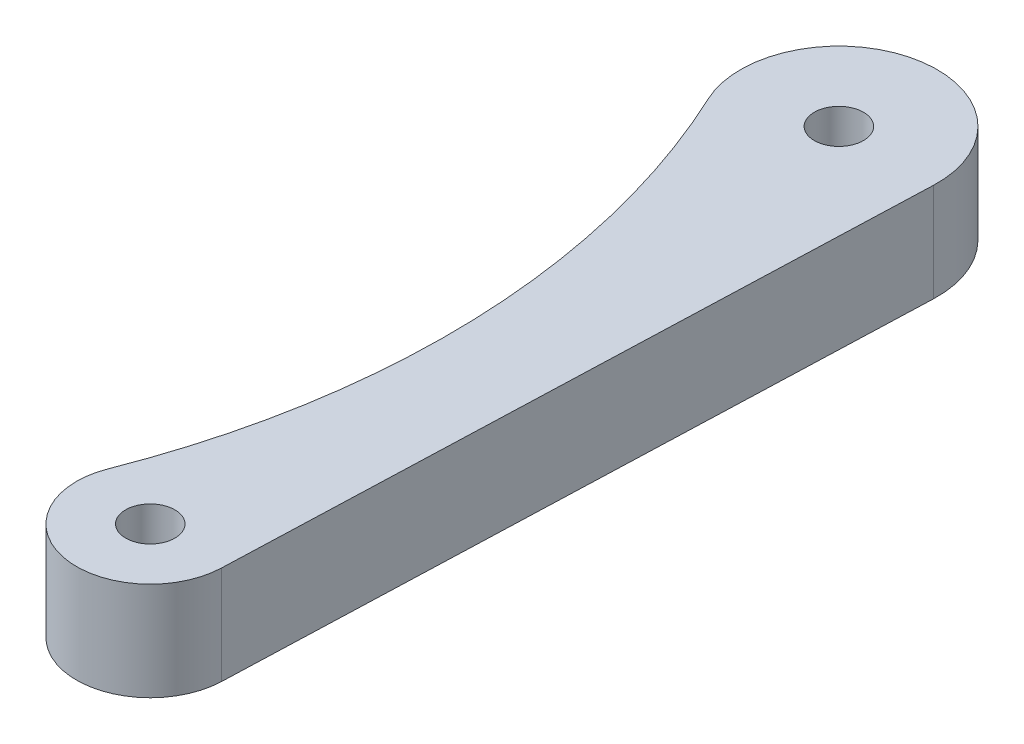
from build123d import *

# Parameters (mm, degrees)
SKETCH1_R           = 2.5
BOSS_EXTRUDE1_DEPTH = 10


with BuildPart() as part:
    # Sketch1 → Boss-Extrude1 (new body)
    with BuildSketch(Plane(origin=(0, 0, 0), x_dir=(1, 0, 0), z_dir=(0, 1, 0))):
        with BuildLine():
            Line((7.495215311, -0.267857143), (9.993620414, 69.642857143))
            ThreePointArc((9.993620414, 69.642857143), (9.998404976, 69.821400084), (10, 70))
            ThreePointArc((10, 70), (0, 80), (-10, 70))
            ThreePointArc((-10, 70), (-9.76117826, 67.827582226), (-9.056120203, 65.758928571))
            ThreePointArc((-9.056120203, 65.758928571), (-1.548187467, 34.456198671), (-6.986149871, 2.728316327))
            ThreePointArc((-6.986149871, 2.728316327), (-7.370418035, 1.388141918), (-7.5, 0))
            ThreePointArc((-7.5, 0), (-0.133949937, -7.498803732), (7.495215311, -0.267857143))
        make_face()
        Circle(SKETCH1_R, mode=Mode.SUBTRACT)
        with Locations((0, 70)):
            Circle(SKETCH1_R, mode=Mode.SUBTRACT)
    extrude(amount=BOSS_EXTRUDE1_DEPTH)


solid = part.part
